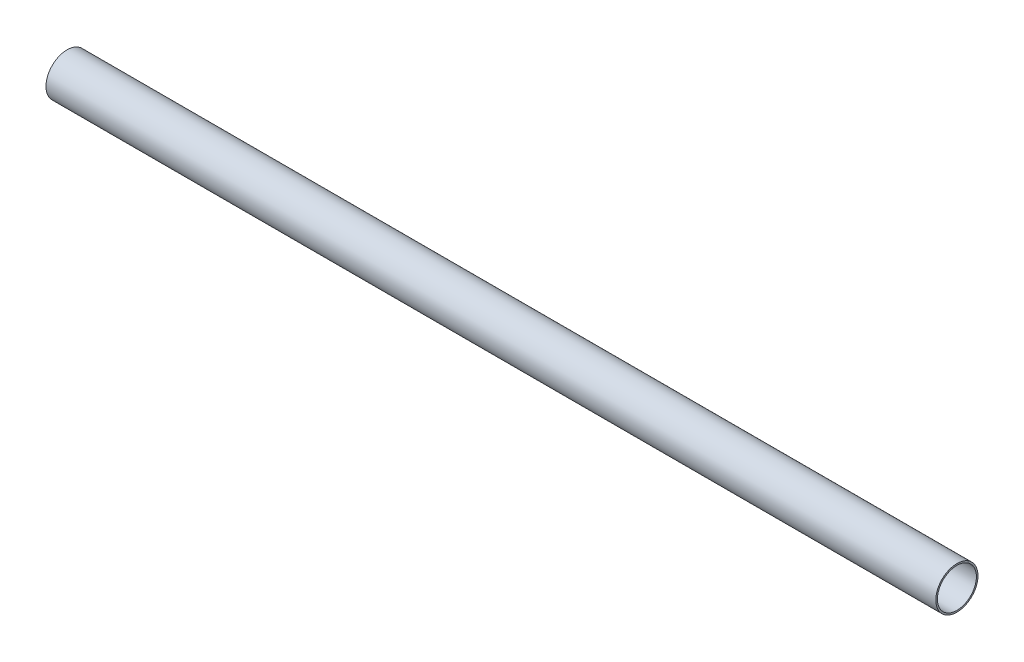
ISO-10303-21;
HEADER;
FILE_DESCRIPTION(('STEP AP214'),'2;1');
FILE_NAME('part.step','',(''),(''),'','','');
FILE_SCHEMA(('AUTOMOTIVE_DESIGN { 1 0 10303 214 1 1 1 1 }'));
ENDSEC;
DATA;
#1=APPLICATION_CONTEXT('core data for automotive mechanical design processes');
#2=APPLICATION_PROTOCOL_DEFINITION('international standard','automotive_design',2000,#1);
#3=PRODUCT_CONTEXT('',#1,'mechanical');
#4=PRODUCT('Part','Part','',(#3));
#5=PRODUCT_RELATED_PRODUCT_CATEGORY('part','',(#4));
#6=PRODUCT_DEFINITION_FORMATION('','',#4);
#7=PRODUCT_DEFINITION_CONTEXT('part definition',#1,'design');
#8=PRODUCT_DEFINITION('design','',#6,#7);
#9=PRODUCT_DEFINITION_SHAPE('','',#8);
#10=(LENGTH_UNIT() NAMED_UNIT(*) SI_UNIT(.MILLI.,.METRE.));
#11=(NAMED_UNIT(*) PLANE_ANGLE_UNIT() SI_UNIT($,.RADIAN.));
#12=(NAMED_UNIT(*) SI_UNIT($,.STERADIAN.) SOLID_ANGLE_UNIT());
#13=UNCERTAINTY_MEASURE_WITH_UNIT(LENGTH_MEASURE(1.E-05),#10,'distance_accuracy_value','');
#14=(GEOMETRIC_REPRESENTATION_CONTEXT(3) GLOBAL_UNCERTAINTY_ASSIGNED_CONTEXT((#13)) GLOBAL_UNIT_ASSIGNED_CONTEXT((#10,
#11,#12)) REPRESENTATION_CONTEXT('',''));
#15=CARTESIAN_POINT('',(0.,0.,0.));
#16=DIRECTION('',(0.,0.,1.));
#17=DIRECTION('',(1.,0.,0.));
#18=AXIS2_PLACEMENT_3D('',#15,#16,#17);
#19=CARTESIAN_POINT('',(444.5,0.,0.));
#20=DIRECTION('',(1.,0.,0.));
#21=DIRECTION('',(0.,0.,-1.));
#22=AXIS2_PLACEMENT_3D('',#19,#20,#21);
#23=PLANE('',#22);
#24=CARTESIAN_POINT('',(444.5,0.,0.));
#25=DIRECTION('',(1.,0.,0.));
#26=DIRECTION('',(0.,0.,-1.));
#27=AXIS2_PLACEMENT_3D('',#24,#25,#26);
#28=CIRCLE('',#27,21.082);
#29=CARTESIAN_POINT('',(444.5,0.,-21.082));
#30=VERTEX_POINT('',#29);
#31=EDGE_CURVE('E10',#30,#30,#28,.T.);
#32=ORIENTED_EDGE('',*,*,#31,.T.);
#33=EDGE_LOOP('',(#32));
#34=FACE_BOUND('',#33,.T.);
#35=CARTESIAN_POINT('',(444.5,0.,0.));
#36=DIRECTION('',(1.,0.,0.));
#37=DIRECTION('',(0.,0.,-1.));
#38=AXIS2_PLACEMENT_3D('',#35,#36,#37);
#39=CIRCLE('',#38,19.4691);
#40=CARTESIAN_POINT('',(444.5,0.,-19.4691));
#41=VERTEX_POINT('',#40);
#42=EDGE_CURVE('E39',#41,#41,#39,.T.);
#43=ORIENTED_EDGE('',*,*,#42,.F.);
#44=EDGE_LOOP('',(#43));
#45=FACE_BOUND('',#44,.T.);
#46=ADVANCED_FACE('F28',(#34,#45),#23,.T.);
#47=CARTESIAN_POINT('',(-444.5,0.,0.));
#48=DIRECTION('',(1.,0.,0.));
#49=DIRECTION('',(0.,0.,-1.));
#50=AXIS2_PLACEMENT_3D('',#47,#48,#49);
#51=PLANE('',#50);
#52=CARTESIAN_POINT('',(-444.5,0.,0.));
#53=DIRECTION('',(1.,0.,0.));
#54=DIRECTION('',(0.,0.,-1.));
#55=AXIS2_PLACEMENT_3D('',#52,#53,#54);
#56=CIRCLE('',#55,21.082);
#57=CARTESIAN_POINT('',(-444.5,0.,-21.082));
#58=VERTEX_POINT('',#57);
#59=EDGE_CURVE('E32',#58,#58,#56,.T.);
#60=ORIENTED_EDGE('',*,*,#59,.F.);
#61=EDGE_LOOP('',(#60));
#62=FACE_BOUND('',#61,.T.);
#63=CARTESIAN_POINT('',(-444.5,0.,0.));
#64=DIRECTION('',(1.,0.,0.));
#65=DIRECTION('',(0.,0.,-1.));
#66=AXIS2_PLACEMENT_3D('',#63,#64,#65);
#67=CIRCLE('',#66,19.4691);
#68=CARTESIAN_POINT('',(-444.5,0.,-19.4691));
#69=VERTEX_POINT('',#68);
#70=EDGE_CURVE('E41',#69,#69,#67,.T.);
#71=ORIENTED_EDGE('',*,*,#70,.T.);
#72=EDGE_LOOP('',(#71));
#73=FACE_BOUND('',#72,.T.);
#74=ADVANCED_FACE('F51',(#62,#73),#51,.F.);
#75=CARTESIAN_POINT('',(444.5,0.,0.));
#76=DIRECTION('',(-1.,0.,0.));
#77=DIRECTION('',(0.,0.,1.));
#78=AXIS2_PLACEMENT_3D('',#75,#76,#77);
#79=CYLINDRICAL_SURFACE('',#78,21.082);
#80=ORIENTED_EDGE('',*,*,#31,.F.);
#81=EDGE_LOOP('',(#80));
#82=FACE_BOUND('',#81,.T.);
#83=ORIENTED_EDGE('',*,*,#59,.T.);
#84=EDGE_LOOP('',(#83));
#85=FACE_BOUND('',#84,.T.);
#86=ADVANCED_FACE('F30',(#82,#85),#79,.T.);
#87=CARTESIAN_POINT('',(444.5,0.,0.));
#88=DIRECTION('',(-1.,0.,0.));
#89=DIRECTION('',(0.,0.,1.));
#90=AXIS2_PLACEMENT_3D('',#87,#88,#89);
#91=CYLINDRICAL_SURFACE('',#90,19.4691);
#92=ORIENTED_EDGE('',*,*,#42,.T.);
#93=EDGE_LOOP('',(#92));
#94=FACE_BOUND('',#93,.T.);
#95=ORIENTED_EDGE('',*,*,#70,.F.);
#96=EDGE_LOOP('',(#95));
#97=FACE_BOUND('',#96,.T.);
#98=ADVANCED_FACE('F47',(#94,#97),#91,.F.);
#99=CLOSED_SHELL('',(#46,#74,#86,#98));
#100=MANIFOLD_SOLID_BREP('B2',#99);
#101=ADVANCED_BREP_SHAPE_REPRESENTATION('',(#18,#100),#14);
#102=SHAPE_DEFINITION_REPRESENTATION(#9,#101);
ENDSEC;
END-ISO-10303-21;
